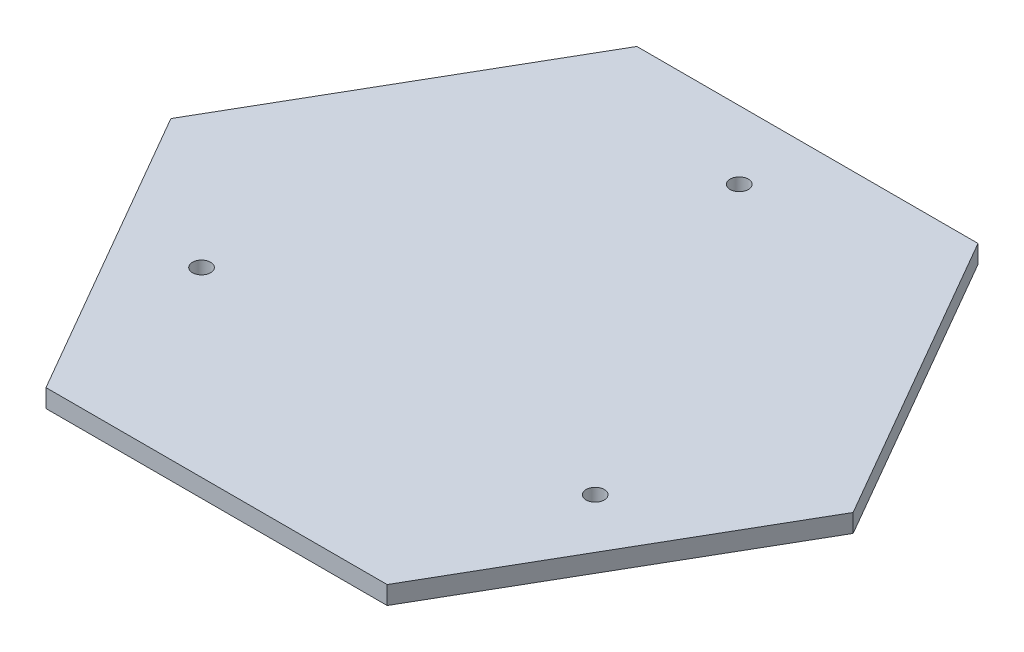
ISO-10303-21;
HEADER;
FILE_DESCRIPTION(('STEP AP214'),'2;1');
FILE_NAME('part.step','',(''),(''),'','','');
FILE_SCHEMA(('AUTOMOTIVE_DESIGN { 1 0 10303 214 1 1 1 1 }'));
ENDSEC;
DATA;
#1=APPLICATION_CONTEXT('core data for automotive mechanical design processes');
#2=APPLICATION_PROTOCOL_DEFINITION('international standard','automotive_design',2000,#1);
#3=PRODUCT_CONTEXT('',#1,'mechanical');
#4=PRODUCT('Part','Part','',(#3));
#5=PRODUCT_RELATED_PRODUCT_CATEGORY('part','',(#4));
#6=PRODUCT_DEFINITION_FORMATION('','',#4);
#7=PRODUCT_DEFINITION_CONTEXT('part definition',#1,'design');
#8=PRODUCT_DEFINITION('design','',#6,#7);
#9=PRODUCT_DEFINITION_SHAPE('','',#8);
#10=(LENGTH_UNIT() NAMED_UNIT(*) SI_UNIT(.MILLI.,.METRE.));
#11=(NAMED_UNIT(*) PLANE_ANGLE_UNIT() SI_UNIT($,.RADIAN.));
#12=(NAMED_UNIT(*) SI_UNIT($,.STERADIAN.) SOLID_ANGLE_UNIT());
#13=UNCERTAINTY_MEASURE_WITH_UNIT(LENGTH_MEASURE(1.E-05),#10,'distance_accuracy_value','');
#14=(GEOMETRIC_REPRESENTATION_CONTEXT(3) GLOBAL_UNCERTAINTY_ASSIGNED_CONTEXT((#13)) GLOBAL_UNIT_ASSIGNED_CONTEXT((#10,
#11,#12)) REPRESENTATION_CONTEXT('',''));
#15=CARTESIAN_POINT('',(0.,0.,0.));
#16=DIRECTION('',(0.,0.,1.));
#17=DIRECTION('',(1.,0.,0.));
#18=AXIS2_PLACEMENT_3D('',#15,#16,#17);
#19=CARTESIAN_POINT('',(18.7638837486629,2.,32.5));
#20=DIRECTION('',(-0.866025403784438,0.,-0.5));
#21=DIRECTION('',(-0.5,0.,0.866025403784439));
#22=AXIS2_PLACEMENT_3D('',#19,#20,#21);
#23=PLANE('',#22);
#24=DIRECTION('',(0.5,0.,-0.866025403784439));
#25=VECTOR('',#24,1.);
#26=CARTESIAN_POINT('',(18.7638837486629,0.,32.5));
#27=LINE('',#26,#25);
#28=CARTESIAN_POINT('',(18.7638837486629,0.,32.5));
#29=VERTEX_POINT('',#28);
#30=CARTESIAN_POINT('',(37.5277674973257,0.,0.));
#31=VERTEX_POINT('',#30);
#32=EDGE_CURVE('E117',#29,#31,#27,.T.);
#33=ORIENTED_EDGE('',*,*,#32,.T.);
#34=DIRECTION('',(0.,-1.,0.));
#35=VECTOR('',#34,1.);
#36=CARTESIAN_POINT('',(37.5277674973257,2.,0.));
#37=LINE('',#36,#35);
#38=CARTESIAN_POINT('',(37.5277674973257,2.,0.));
#39=VERTEX_POINT('',#38);
#40=EDGE_CURVE('E11',#39,#31,#37,.T.);
#41=ORIENTED_EDGE('',*,*,#40,.F.);
#42=DIRECTION('',(0.5,0.,-0.866025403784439));
#43=VECTOR('',#42,1.);
#44=CARTESIAN_POINT('',(18.7638837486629,2.,32.5));
#45=LINE('',#44,#43);
#46=CARTESIAN_POINT('',(18.7638837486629,2.,32.5));
#47=VERTEX_POINT('',#46);
#48=EDGE_CURVE('E128',#47,#39,#45,.T.);
#49=ORIENTED_EDGE('',*,*,#48,.F.);
#50=DIRECTION('',(0.,-1.,0.));
#51=VECTOR('',#50,1.);
#52=CARTESIAN_POINT('',(18.7638837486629,2.,32.5));
#53=LINE('',#52,#51);
#54=EDGE_CURVE('E113',#47,#29,#53,.T.);
#55=ORIENTED_EDGE('',*,*,#54,.T.);
#56=EDGE_LOOP('',(#33,#41,#49,#55));
#57=FACE_BOUND('',#56,.T.);
#58=ADVANCED_FACE('F33',(#57),#23,.F.);
#59=CARTESIAN_POINT('',(37.5277674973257,2.,0.));
#60=DIRECTION('',(-0.866025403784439,0.,0.5));
#61=DIRECTION('',(0.5,0.,0.866025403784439));
#62=AXIS2_PLACEMENT_3D('',#59,#60,#61);
#63=PLANE('',#62);
#64=DIRECTION('',(-0.5,0.,-0.866025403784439));
#65=VECTOR('',#64,1.);
#66=CARTESIAN_POINT('',(37.5277674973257,0.,0.));
#67=LINE('',#66,#65);
#68=CARTESIAN_POINT('',(18.7638837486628,0.,-32.5));
#69=VERTEX_POINT('',#68);
#70=EDGE_CURVE('E120',#31,#69,#67,.T.);
#71=ORIENTED_EDGE('',*,*,#70,.T.);
#72=DIRECTION('',(0.,-1.,0.));
#73=VECTOR('',#72,1.);
#74=CARTESIAN_POINT('',(18.7638837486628,2.,-32.5));
#75=LINE('',#74,#73);
#76=CARTESIAN_POINT('',(18.7638837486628,2.,-32.5));
#77=VERTEX_POINT('',#76);
#78=EDGE_CURVE('E41',#77,#69,#75,.T.);
#79=ORIENTED_EDGE('',*,*,#78,.F.);
#80=DIRECTION('',(-0.5,0.,-0.866025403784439));
#81=VECTOR('',#80,1.);
#82=CARTESIAN_POINT('',(37.5277674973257,2.,0.));
#83=LINE('',#82,#81);
#84=EDGE_CURVE('E86',#39,#77,#83,.T.);
#85=ORIENTED_EDGE('',*,*,#84,.F.);
#86=ORIENTED_EDGE('',*,*,#40,.T.);
#87=EDGE_LOOP('',(#71,#79,#85,#86));
#88=FACE_BOUND('',#87,.T.);
#89=ADVANCED_FACE('F153',(#88),#63,.F.);
#90=CARTESIAN_POINT('',(18.7638837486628,2.,-32.5));
#91=DIRECTION('',(0.,0.,1.));
#92=DIRECTION('',(1.,0.,0.));
#93=AXIS2_PLACEMENT_3D('',#90,#91,#92);
#94=PLANE('',#93);
#95=DIRECTION('',(-1.,0.,0.));
#96=VECTOR('',#95,1.);
#97=CARTESIAN_POINT('',(18.7638837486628,0.,-32.5));
#98=LINE('',#97,#96);
#99=CARTESIAN_POINT('',(-18.7638837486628,0.,-32.5));
#100=VERTEX_POINT('',#99);
#101=EDGE_CURVE('E123',#69,#100,#98,.T.);
#102=ORIENTED_EDGE('',*,*,#101,.T.);
#103=DIRECTION('',(0.,-1.,0.));
#104=VECTOR('',#103,1.);
#105=CARTESIAN_POINT('',(-18.7638837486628,2.,-32.5));
#106=LINE('',#105,#104);
#107=CARTESIAN_POINT('',(-18.7638837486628,2.,-32.5));
#108=VERTEX_POINT('',#107);
#109=EDGE_CURVE('E108',#108,#100,#106,.T.);
#110=ORIENTED_EDGE('',*,*,#109,.F.);
#111=DIRECTION('',(-1.,0.,0.));
#112=VECTOR('',#111,1.);
#113=CARTESIAN_POINT('',(18.7638837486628,2.,-32.5));
#114=LINE('',#113,#112);
#115=EDGE_CURVE('E99',#77,#108,#114,.T.);
#116=ORIENTED_EDGE('',*,*,#115,.F.);
#117=ORIENTED_EDGE('',*,*,#78,.T.);
#118=EDGE_LOOP('',(#102,#110,#116,#117));
#119=FACE_BOUND('',#118,.T.);
#120=ADVANCED_FACE('F134',(#119),#94,.F.);
#121=CARTESIAN_POINT('',(-18.7638837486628,2.,-32.5));
#122=DIRECTION('',(0.866025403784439,0.,0.5));
#123=DIRECTION('',(0.5,0.,-0.866025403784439));
#124=AXIS2_PLACEMENT_3D('',#121,#122,#123);
#125=PLANE('',#124);
#126=DIRECTION('',(-0.5,0.,0.866025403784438));
#127=VECTOR('',#126,1.);
#128=CARTESIAN_POINT('',(-18.7638837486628,0.,-32.5));
#129=LINE('',#128,#127);
#130=CARTESIAN_POINT('',(-37.5277674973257,0.,0.));
#131=VERTEX_POINT('',#130);
#132=EDGE_CURVE('E107',#100,#131,#129,.T.);
#133=ORIENTED_EDGE('',*,*,#132,.T.);
#134=DIRECTION('',(0.,-1.,0.));
#135=VECTOR('',#134,1.);
#136=CARTESIAN_POINT('',(-37.5277674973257,2.,0.));
#137=LINE('',#136,#135);
#138=CARTESIAN_POINT('',(-37.5277674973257,2.,0.));
#139=VERTEX_POINT('',#138);
#140=EDGE_CURVE('E104',#139,#131,#137,.T.);
#141=ORIENTED_EDGE('',*,*,#140,.F.);
#142=DIRECTION('',(-0.5,0.,0.866025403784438));
#143=VECTOR('',#142,1.);
#144=CARTESIAN_POINT('',(-18.7638837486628,2.,-32.5));
#145=LINE('',#144,#143);
#146=EDGE_CURVE('E93',#108,#139,#145,.T.);
#147=ORIENTED_EDGE('',*,*,#146,.F.);
#148=ORIENTED_EDGE('',*,*,#109,.T.);
#149=EDGE_LOOP('',(#133,#141,#147,#148));
#150=FACE_BOUND('',#149,.T.);
#151=ADVANCED_FACE('F105',(#150),#125,.F.);
#152=CARTESIAN_POINT('',(-37.5277674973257,2.,0.));
#153=DIRECTION('',(0.866025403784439,0.,-0.5));
#154=DIRECTION('',(-0.5,0.,-0.866025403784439));
#155=AXIS2_PLACEMENT_3D('',#152,#153,#154);
#156=PLANE('',#155);
#157=DIRECTION('',(0.5,0.,0.866025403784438));
#158=VECTOR('',#157,1.);
#159=CARTESIAN_POINT('',(-37.5277674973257,0.,0.));
#160=LINE('',#159,#158);
#161=CARTESIAN_POINT('',(-18.7638837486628,0.,32.5));
#162=VERTEX_POINT('',#161);
#163=EDGE_CURVE('E72',#131,#162,#160,.T.);
#164=ORIENTED_EDGE('',*,*,#163,.T.);
#165=DIRECTION('',(0.,-1.,0.));
#166=VECTOR('',#165,1.);
#167=CARTESIAN_POINT('',(-18.7638837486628,2.,32.5));
#168=LINE('',#167,#166);
#169=CARTESIAN_POINT('',(-18.7638837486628,2.,32.5));
#170=VERTEX_POINT('',#169);
#171=EDGE_CURVE('E109',#170,#162,#168,.T.);
#172=ORIENTED_EDGE('',*,*,#171,.F.);
#173=DIRECTION('',(0.5,0.,0.866025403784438));
#174=VECTOR('',#173,1.);
#175=CARTESIAN_POINT('',(-37.5277674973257,2.,0.));
#176=LINE('',#175,#174);
#177=EDGE_CURVE('E97',#139,#170,#176,.T.);
#178=ORIENTED_EDGE('',*,*,#177,.F.);
#179=ORIENTED_EDGE('',*,*,#140,.T.);
#180=EDGE_LOOP('',(#164,#172,#178,#179));
#181=FACE_BOUND('',#180,.T.);
#182=ADVANCED_FACE('F111',(#181),#156,.F.);
#183=CARTESIAN_POINT('',(-18.7638837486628,2.,32.5));
#184=DIRECTION('',(0.,0.,-1.));
#185=DIRECTION('',(-1.,0.,0.));
#186=AXIS2_PLACEMENT_3D('',#183,#184,#185);
#187=PLANE('',#186);
#188=DIRECTION('',(1.,0.,0.));
#189=VECTOR('',#188,1.);
#190=CARTESIAN_POINT('',(-18.7638837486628,0.,32.5));
#191=LINE('',#190,#189);
#192=EDGE_CURVE('E78',#162,#29,#191,.T.);
#193=ORIENTED_EDGE('',*,*,#192,.T.);
#194=ORIENTED_EDGE('',*,*,#54,.F.);
#195=DIRECTION('',(1.,0.,0.));
#196=VECTOR('',#195,1.);
#197=CARTESIAN_POINT('',(-18.7638837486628,2.,32.5));
#198=LINE('',#197,#196);
#199=EDGE_CURVE('E49',#170,#47,#198,.T.);
#200=ORIENTED_EDGE('',*,*,#199,.F.);
#201=ORIENTED_EDGE('',*,*,#171,.T.);
#202=EDGE_LOOP('',(#193,#194,#200,#201));
#203=FACE_BOUND('',#202,.T.);
#204=ADVANCED_FACE('F141',(#203),#187,.F.);
#205=CARTESIAN_POINT('',(0.,2.,0.));
#206=DIRECTION('',(0.,1.,0.));
#207=DIRECTION('',(0.,0.,1.));
#208=AXIS2_PLACEMENT_3D('',#205,#206,#207);
#209=PLANE('',#208);
#210=CARTESIAN_POINT('',(0.,2.,-25.));
#211=DIRECTION('',(0.,1.,0.));
#212=DIRECTION('',(0.,0.,1.));
#213=AXIS2_PLACEMENT_3D('',#210,#211,#212);
#214=CIRCLE('',#213,1.);
#215=CARTESIAN_POINT('',(0.,2.,-24.));
#216=VERTEX_POINT('',#215);
#217=EDGE_CURVE('E121',#216,#216,#214,.F.);
#218=ORIENTED_EDGE('',*,*,#217,.T.);
#219=EDGE_LOOP('',(#218));
#220=FACE_BOUND('',#219,.T.);
#221=CARTESIAN_POINT('',(21.650635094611,2.,12.5));
#222=DIRECTION('',(0.,1.,0.));
#223=DIRECTION('',(0.,0.,1.));
#224=AXIS2_PLACEMENT_3D('',#221,#222,#223);
#225=CIRCLE('',#224,1.);
#226=CARTESIAN_POINT('',(21.650635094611,2.,13.5));
#227=VERTEX_POINT('',#226);
#228=EDGE_CURVE('E233',#227,#227,#225,.F.);
#229=ORIENTED_EDGE('',*,*,#228,.T.);
#230=EDGE_LOOP('',(#229));
#231=FACE_BOUND('',#230,.T.);
#232=CARTESIAN_POINT('',(-21.650635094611,2.,12.5));
#233=DIRECTION('',(0.,1.,0.));
#234=DIRECTION('',(0.,0.,1.));
#235=AXIS2_PLACEMENT_3D('',#232,#233,#234);
#236=CIRCLE('',#235,1.);
#237=CARTESIAN_POINT('',(-21.650635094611,2.,13.5));
#238=VERTEX_POINT('',#237);
#239=EDGE_CURVE('E229',#238,#238,#236,.F.);
#240=ORIENTED_EDGE('',*,*,#239,.T.);
#241=EDGE_LOOP('',(#240));
#242=FACE_BOUND('',#241,.T.);
#243=ORIENTED_EDGE('',*,*,#48,.T.);
#244=ORIENTED_EDGE('',*,*,#84,.T.);
#245=ORIENTED_EDGE('',*,*,#115,.T.);
#246=ORIENTED_EDGE('',*,*,#146,.T.);
#247=ORIENTED_EDGE('',*,*,#177,.T.);
#248=ORIENTED_EDGE('',*,*,#199,.T.);
#249=EDGE_LOOP('',(#243,#244,#245,#246,#247,#248));
#250=FACE_BOUND('',#249,.T.);
#251=ADVANCED_FACE('F95',(#220,#231,#242,#250),#209,.T.);
#252=CARTESIAN_POINT('',(0.,0.,0.));
#253=DIRECTION('',(0.,1.,0.));
#254=DIRECTION('',(0.,0.,1.));
#255=AXIS2_PLACEMENT_3D('',#252,#253,#254);
#256=PLANE('',#255);
#257=CARTESIAN_POINT('',(0.,0.,-25.));
#258=DIRECTION('',(0.,1.,0.));
#259=DIRECTION('',(0.,0.,1.));
#260=AXIS2_PLACEMENT_3D('',#257,#258,#259);
#261=CIRCLE('',#260,1.);
#262=CARTESIAN_POINT('',(0.,0.,-24.));
#263=VERTEX_POINT('',#262);
#264=EDGE_CURVE('E228',#263,#263,#261,.T.);
#265=ORIENTED_EDGE('',*,*,#264,.T.);
#266=EDGE_LOOP('',(#265));
#267=FACE_BOUND('',#266,.T.);
#268=CARTESIAN_POINT('',(21.650635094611,0.,12.5));
#269=DIRECTION('',(0.,1.,0.));
#270=DIRECTION('',(0.,0.,1.));
#271=AXIS2_PLACEMENT_3D('',#268,#269,#270);
#272=CIRCLE('',#271,1.);
#273=CARTESIAN_POINT('',(21.650635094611,0.,13.5));
#274=VERTEX_POINT('',#273);
#275=EDGE_CURVE('E230',#274,#274,#272,.T.);
#276=ORIENTED_EDGE('',*,*,#275,.T.);
#277=EDGE_LOOP('',(#276));
#278=FACE_BOUND('',#277,.T.);
#279=CARTESIAN_POINT('',(-21.650635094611,0.,12.5));
#280=DIRECTION('',(0.,1.,0.));
#281=DIRECTION('',(0.,0.,1.));
#282=AXIS2_PLACEMENT_3D('',#279,#280,#281);
#283=CIRCLE('',#282,1.);
#284=CARTESIAN_POINT('',(-21.650635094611,0.,13.5));
#285=VERTEX_POINT('',#284);
#286=EDGE_CURVE('E236',#285,#285,#283,.T.);
#287=ORIENTED_EDGE('',*,*,#286,.T.);
#288=EDGE_LOOP('',(#287));
#289=FACE_BOUND('',#288,.T.);
#290=ORIENTED_EDGE('',*,*,#32,.F.);
#291=ORIENTED_EDGE('',*,*,#192,.F.);
#292=ORIENTED_EDGE('',*,*,#163,.F.);
#293=ORIENTED_EDGE('',*,*,#132,.F.);
#294=ORIENTED_EDGE('',*,*,#101,.F.);
#295=ORIENTED_EDGE('',*,*,#70,.F.);
#296=EDGE_LOOP('',(#290,#291,#292,#293,#294,#295));
#297=FACE_BOUND('',#296,.T.);
#298=ADVANCED_FACE('F137',(#267,#278,#289,#297),#256,.F.);
#299=CARTESIAN_POINT('',(-21.650635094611,21.,12.5));
#300=DIRECTION('',(0.,-1.,0.));
#301=DIRECTION('',(0.,0.,-1.));
#302=AXIS2_PLACEMENT_3D('',#299,#300,#301);
#303=CYLINDRICAL_SURFACE('',#302,1.);
#304=ORIENTED_EDGE('',*,*,#239,.F.);
#305=EDGE_LOOP('',(#304));
#306=FACE_BOUND('',#305,.T.);
#307=ORIENTED_EDGE('',*,*,#286,.F.);
#308=EDGE_LOOP('',(#307));
#309=FACE_BOUND('',#308,.T.);
#310=ADVANCED_FACE('F190',(#306,#309),#303,.F.);
#311=CARTESIAN_POINT('',(21.650635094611,21.,12.5));
#312=DIRECTION('',(0.,-1.,0.));
#313=DIRECTION('',(0.,0.,-1.));
#314=AXIS2_PLACEMENT_3D('',#311,#312,#313);
#315=CYLINDRICAL_SURFACE('',#314,1.);
#316=ORIENTED_EDGE('',*,*,#228,.F.);
#317=EDGE_LOOP('',(#316));
#318=FACE_BOUND('',#317,.T.);
#319=ORIENTED_EDGE('',*,*,#275,.F.);
#320=EDGE_LOOP('',(#319));
#321=FACE_BOUND('',#320,.T.);
#322=ADVANCED_FACE('F199',(#318,#321),#315,.F.);
#323=CARTESIAN_POINT('',(0.,21.,-25.));
#324=DIRECTION('',(0.,-1.,0.));
#325=DIRECTION('',(0.,0.,-1.));
#326=AXIS2_PLACEMENT_3D('',#323,#324,#325);
#327=CYLINDRICAL_SURFACE('',#326,1.);
#328=ORIENTED_EDGE('',*,*,#217,.F.);
#329=EDGE_LOOP('',(#328));
#330=FACE_BOUND('',#329,.T.);
#331=ORIENTED_EDGE('',*,*,#264,.F.);
#332=EDGE_LOOP('',(#331));
#333=FACE_BOUND('',#332,.T.);
#334=ADVANCED_FACE('F209',(#330,#333),#327,.F.);
#335=CLOSED_SHELL('',(#58,#89,#120,#151,#182,#204,#251,#298,#310,#322,#334));
#336=MANIFOLD_SOLID_BREP('B2',#335);
#337=ADVANCED_BREP_SHAPE_REPRESENTATION('',(#18,#336),#14);
#338=SHAPE_DEFINITION_REPRESENTATION(#9,#337);
ENDSEC;
END-ISO-10303-21;
